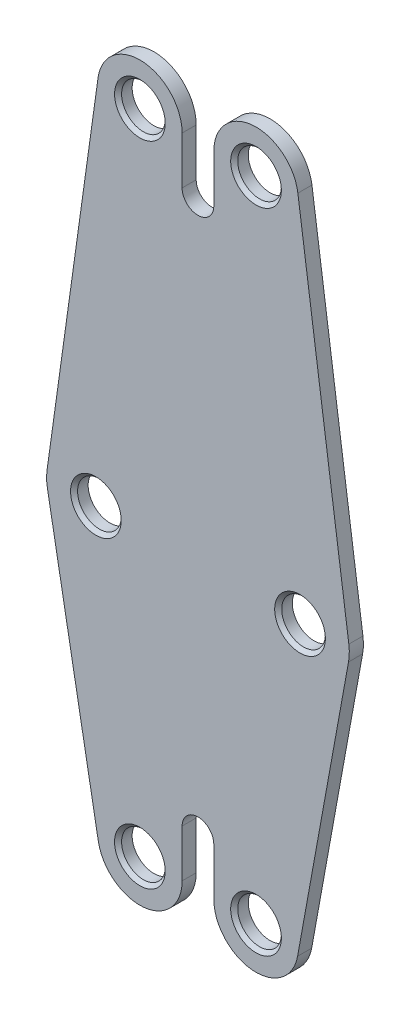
from build123d import *

# Parameters (mm, degrees)
ESQUISSE1_R          = 3.1
BASE_EXTRUSION_DEPTH = 2
CHANFREIN1_SIZE      = 0.5


with BuildPart() as part:
    # Esquisse1 → Base-Extrusion (new body)
    with BuildSketch(Plane.XY):
        with BuildLine():
            Line((2.25, 45.25), (2.25, 52))
            ThreePointArc((2.25, 52), (7.834194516, 57.985574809), (14.1923686, 52.829611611))
            Line((14.1923686, 52.829611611), (21.432763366, 0.967880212))
            ThreePointArc((21.432763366, 0.967880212), (21.498530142, -0.143442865), (21.387282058, -1.251137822))
            Line((21.387282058, -1.251137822), (14.153384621, -41.072403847))
            ThreePointArc((14.153384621, -41.072403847), (7.711626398, -45.975797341), (2.25, -40))
            Line((2.25, -40), (2.25, -33.25))
            ThreePointArc((2.25, -33.25), (0, -31), (-2.25, -33.25))
            Line((-2.25, -33.25), (-2.25, -40))
            ThreePointArc((-2.25, -40), (-7.711626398, -45.975797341), (-14.153384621, -41.072403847))
            Line((-14.153384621, -41.072403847), (-21.387282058, -1.251137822))
            ThreePointArc((-21.387282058, -1.251137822), (-21.498530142, -0.143442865), (-21.432763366, 0.967880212))
            Line((-21.432763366, 0.967880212), (-14.1923686, 52.829611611))
            ThreePointArc((-14.1923686, 52.829611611), (-7.834194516, 57.985574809), (-2.25, 52))
            Line((-2.25, 52), (-2.25, 45.25))
            ThreePointArc((-2.25, 45.25), (0, 43), (2.25, 45.25))
        make_face()
        with Locations((-8.25, 52)):
            Circle(ESQUISSE1_R, mode=Mode.SUBTRACT)
        with Locations((8.25, 52)):
            Circle(ESQUISSE1_R, mode=Mode.SUBTRACT)
        with Locations((-14.5, 0)):
            Circle(ESQUISSE1_R, mode=Mode.SUBTRACT)
        with Locations((14.5, 0)):
            Circle(ESQUISSE1_R, mode=Mode.SUBTRACT)
        with Locations((-8.25, -40)):
            Circle(ESQUISSE1_R, mode=Mode.SUBTRACT)
        with Locations((8.25, -40)):
            Circle(ESQUISSE1_R, mode=Mode.SUBTRACT)
    extrude(amount=BASE_EXTRUSION_DEPTH)

    # Chanfrein1
    chanfrein1_edges = [part.edges().sort_by_distance(p)[0] for p in [
        (-11.35, 52, 2),
        (5.15, 52, 2),
        (-17.6, 0, 2),
        (11.4, 0, 2),
        (-11.35, -40, 2),
        (5.15, -40, 2),
    ]]
    chamfer(chanfrein1_edges, length=CHANFREIN1_SIZE)


solid = part.part
